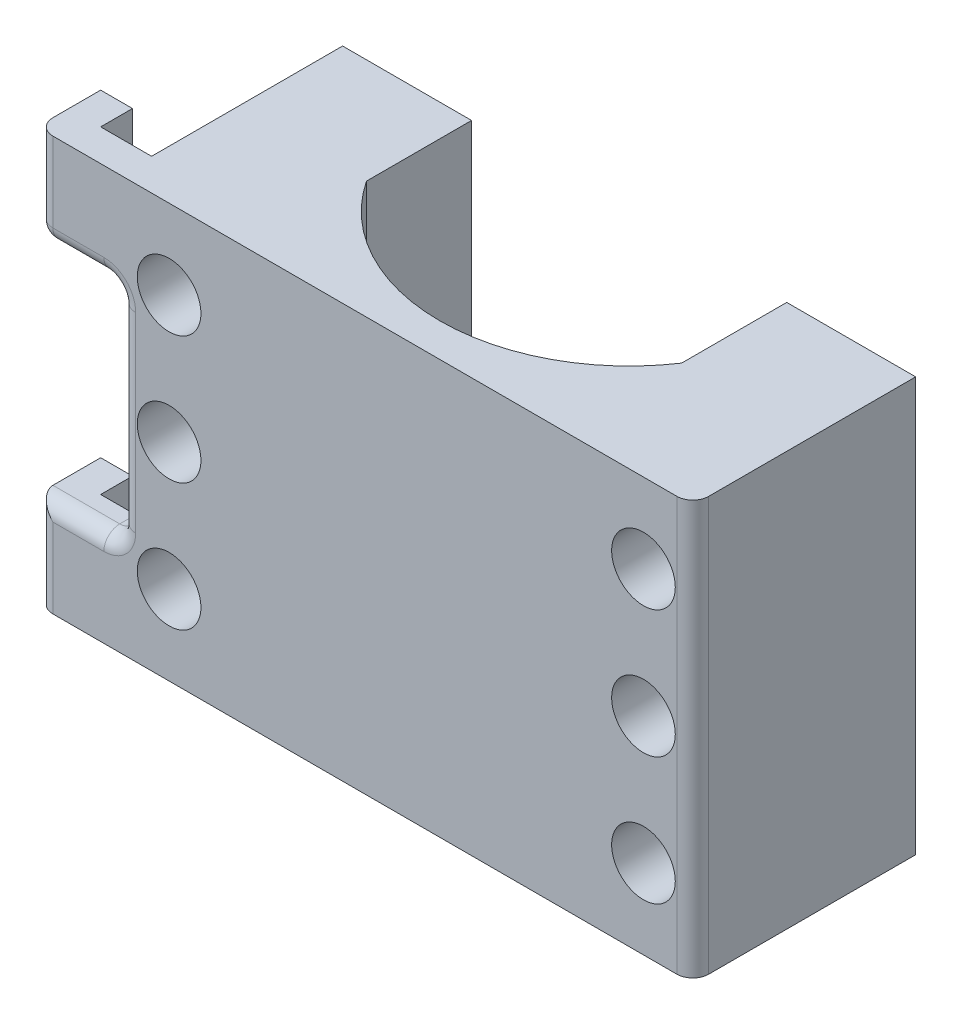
from build123d import *

# Parameters (mm, degrees)
SKETCH_1_W          = 3.05
SKETCH_1_H          = 13
SKETCH_1_R          = 1
SKETCH_1_W_2        = 11.9
EXTRUDE_1_DEPTH     = 14
SKETCH_2_R          = 1
CUT_EXTRUDE_1_DEPTH = 18.867568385
CUT_EXTRUDE_2_DEPTH = 22.118712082
SKETCH_5_W          = 18
SKETCH_5_H          = 13
CUT_EXTRUDE_3_DEPTH = 7
SKETCH_6_W          = 1
SKETCH_6_H          = 13
EXTRUDE_2_DEPTH     = 1.6
SKETCH_7_W          = 2
SKETCH_7_H          = 13
EXTRUDE_3_DEPTH     = 1
CUT_EXTRUDE_6_REACH = 27.741
SKETCH_8_W          = 4
SKETCH_8_H          = 7
FILLET_1_R          = 0.5


with BuildPart() as part:
    # Sketch 1 → Extrude 1 (new body)
    # profile 1 of 4: a face of its own
    with BuildSketch(Plane.XY):
        with Locations((-7.475, 0)):
            Rectangle(SKETCH_1_W, SKETCH_1_H)
        with Locations((-7.45, 4)):
            Circle(SKETCH_1_R, mode=Mode.SUBTRACT)
    # profile 2 of 4: a face of its own
    with BuildSketch(Plane.XY):
        Rectangle(SKETCH_1_W_2, SKETCH_1_H)
    # profile 3 of 4: a face of its own
    with BuildSketch(Plane.XY):
        with Locations((7.475, 0)):
            Rectangle(SKETCH_1_W, SKETCH_1_H)
    # profile 4 of 4: a face of its own
    with BuildSketch(Plane.XY):
        with Locations((-7.45, 4)):
            Circle(SKETCH_1_R)
    extrude(amount=EXTRUDE_1_DEPTH)

    # Sketch 2 → Cut-Extrude 1 (cut, through all)
    with BuildSketch(Plane.XY.offset(14)):
        with Locations((-7.45, 4)):
            Circle(SKETCH_2_R)
        with Locations(Location((-7.45, -4, 0), (0, 0, 180))):
            Circle(SKETCH_2_R)
        with Locations((7.45, -4)):
            Circle(SKETCH_2_R)
        with Locations(Location((7.45, 4, 0), (0, 0, 180))):
            Circle(SKETCH_2_R)
        with Locations((-7.45, 0)):
            Circle(SKETCH_2_R)
        with Locations(Location((7.45, 0, 0), (0, 0, 180))):
            Circle(SKETCH_2_R)
    extrude(amount=-CUT_EXTRUDE_1_DEPTH, mode=Mode.SUBTRACT)

    # Sketch 4 → Cut-Extrude 2 (cut, through all)
    with BuildSketch(Plane(origin=(0, 6.5, 0), x_dir=(1, 0, 0), z_dir=(0, 1, 0))):
        with BuildLine():
            Line((4.95, -10.301514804), (4.95, -3.698485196))
            ThreePointArc((4.95, -3.698485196), (0, -1.05), (-4.95, -3.698485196))
            Line((-4.95, -3.698485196), (-4.95, -10.301514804))
            ThreePointArc((-4.95, -10.301514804), (0, -12.95), (4.95, -10.301514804))
        make_face()
    extrude(amount=-CUT_EXTRUDE_2_DEPTH, mode=Mode.SUBTRACT)

    # Sketch 5 → Cut-Extrude 3 (cut)
    with BuildSketch(Plane(origin=(0, 0, 0), x_dir=(-1, 0, 0), z_dir=(0, 0, -1))):
        Rectangle(SKETCH_5_W, SKETCH_5_H)
    extrude(amount=-CUT_EXTRUDE_3_DEPTH, mode=Mode.SUBTRACT)

    # Sketch 6 → Extrude 2 (add)
    with BuildSketch(Plane.ZY.offset(9)):
        with Locations((13.5, 0)):
            Rectangle(SKETCH_6_W, SKETCH_6_H)
    extrude(amount=EXTRUDE_2_DEPTH)

    # Sketch 7 → Extrude 3 (add)
    with BuildSketch(Plane.ZY.offset(10.6)):
        with Locations((13, 0)):
            Rectangle(SKETCH_7_W, SKETCH_7_H)
    extrude(amount=EXTRUDE_3_DEPTH)

    # Cut-Extrude 6: up to this face of the body (flat: up to its plane)
    cut_extrude_6_end = Plane(part.part.faces().sort_by_distance((-9, 0, 10))[0])
    # Sketch 8 → Cut-Extrude 6 (cut, up to the picked face)
    with BuildSketch(Plane.ZY.offset(11.6), mode=Mode.PRIVATE) as cut_extrude_6_sk1:
        with Locations((12, 0)):
            Rectangle(SKETCH_8_W, SKETCH_8_H)
    cut_extrude_6_tool1 = split(extrude(cut_extrude_6_sk1.sketch, amount=-CUT_EXTRUDE_6_REACH, mode=Mode.PRIVATE), bisect_by=cut_extrude_6_end, keep=Keep.BOTH, mode=Mode.PRIVATE)
    add(cut_extrude_6_tool1.solids().sort_by(Axis((-11.6, 0, 12), (1, 0, 0)))[0], mode=Mode.SUBTRACT)

    # Fillet 1
    fillet_1_edges = [part.edges().sort_by_distance(p)[0] for p in [
        (-11.6, -5, 14),
        (-11.6, 5, 14),
        (-9, 3.5, 13.5),
        (-9, 0, 14),
        (-9, -3.5, 13.5),
        (-11.6, 3.5, 13),
        (-10.3, -3.5, 14),
        (-10.3, 3.5, 14),
        (9, 0, 14),
    ]]
    fillet(fillet_1_edges, radius=FILLET_1_R)


solid = part.part
